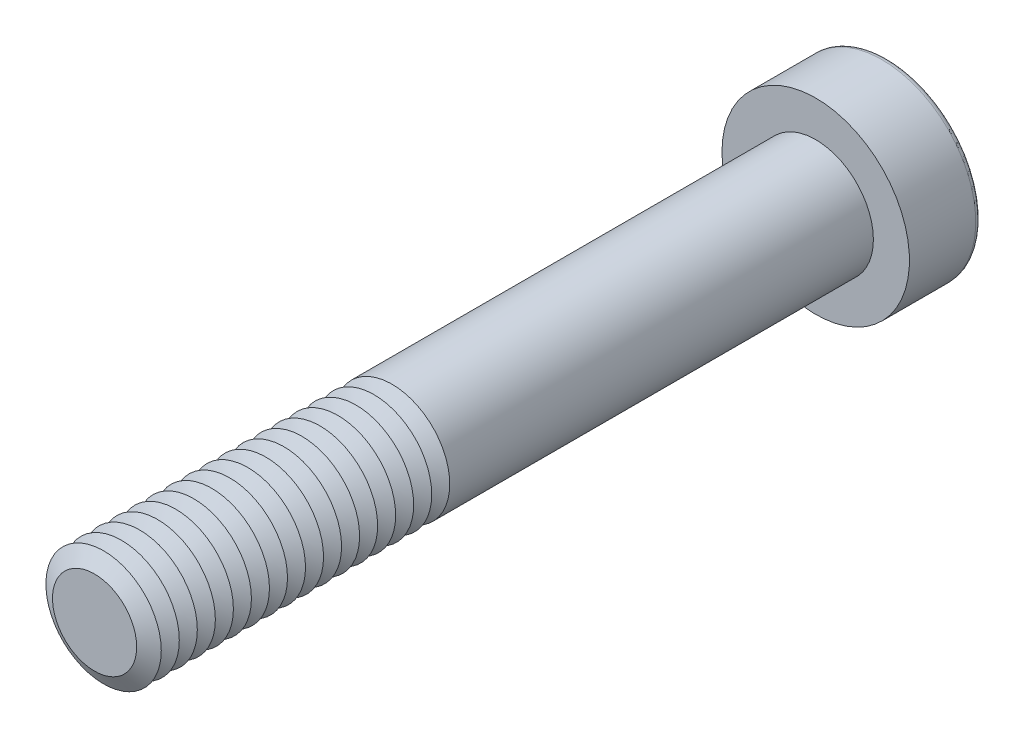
from build123d import *

# Parameters (mm, degrees)
SKETCH1_R           = 4
BOSS_EXTRUDE1_DEPTH = 50
SKETCH2_R           = 6.5
BOSS_EXTRUDE2_DEPTH = 5
CUT_EXTRUDE1_DEPTH  = 3.75
FILLET1_R           = 0.4
LPATTERN1_COUNT     = 17
LPATTERN1_PITCH     = 1.25


with BuildPart() as part:
    # Sketch1 → Boss-Extrude1 (new body)
    with BuildSketch(Plane.XY):
        Circle(SKETCH1_R)
    extrude(amount=BOSS_EXTRUDE1_DEPTH)

    # Sketch2 → Boss-Extrude2 (add)
    with BuildSketch(Plane(origin=(0, 0, 0), x_dir=(-1, 0, 0), z_dir=(0, 0, -1))):
        Circle(SKETCH2_R)
    extrude(amount=BOSS_EXTRUDE2_DEPTH)

    # Sketch3 → Cut-Extrude1 (cut)
    with BuildSketch(Plane(origin=(0, 0, -5), x_dir=(-1, 0, 0), z_dir=(0, 0, -1))):
        Polygon((-1.443375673, 2.5), (-2.886751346, 0), (-1.443375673, -2.5), (1.443375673, -2.5), (2.886751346, 0), (1.443375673, 2.5), align=None)
    extrude(amount=-CUT_EXTRUDE1_DEPTH, mode=Mode.SUBTRACT)

    # Fillet1
    fillet1_edges = [part.edges().sort_by_distance(p)[0] for p in [
        (6.5, 0, -5),
    ]]
    fillet(fillet1_edges, radius=FILLET1_R)

    # Cut-Extrude2 cone 1 section (on through the dimple's axis) → Cut-Extrude2 (revolve, cut)
    with BuildSketch(Plane(origin=(0, 0, -1.25), x_dir=(0, 1, 0), z_dir=(1, 0, 0))):
        Polygon((0, 0), (2.5, 0), (0, 1.443375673), align=None)
    revolve(axis=Axis((0, 0, -1.25), (0, 0, 1)), mode=Mode.SUBTRACT)

    # Cut-Extrude3 cone 1 section (on through the dimple's axis) → Cut-Extrude3 (revolve, cut)
    with BuildSketch(Plane(origin=(0, 0, -5), x_dir=(0, 1, 0), z_dir=(1, 0, 0))):
        Polygon((0, 0), (2.886751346, 0), (0, 0.773502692), align=None)
    revolve(axis=Axis((0, 0, -5), (0, 0, 1)), mode=Mode.SUBTRACT)

    # Sketch7 → Cut-Revolve1 (revolve, cut)
    with BuildSketch(Plane(origin=(0, 0, 0), x_dir=(0, 0, -1), z_dir=(1, 0, 0)), mode=Mode.PRIVATE) as cut_revolve1_sk:
        Polygon((-50, 2.917468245), (-49.375, 4), (-50.625, 4), align=None)
    cut_revolve1 = revolve(cut_revolve1_sk.sketch.rotate(Axis((0, 0, 50), (0, 0, -1)), 90), axis=Axis((0, 0, 50), (0, 0, -1)), mode=Mode.SUBTRACT)

    # LPattern1: Cut-Revolve1 ×17
    with Locations(*[(0, 0, -i * LPATTERN1_PITCH) for i in range(1, LPATTERN1_COUNT)]):
        add(cut_revolve1, mode=Mode.SUBTRACT)


solid = part.part
